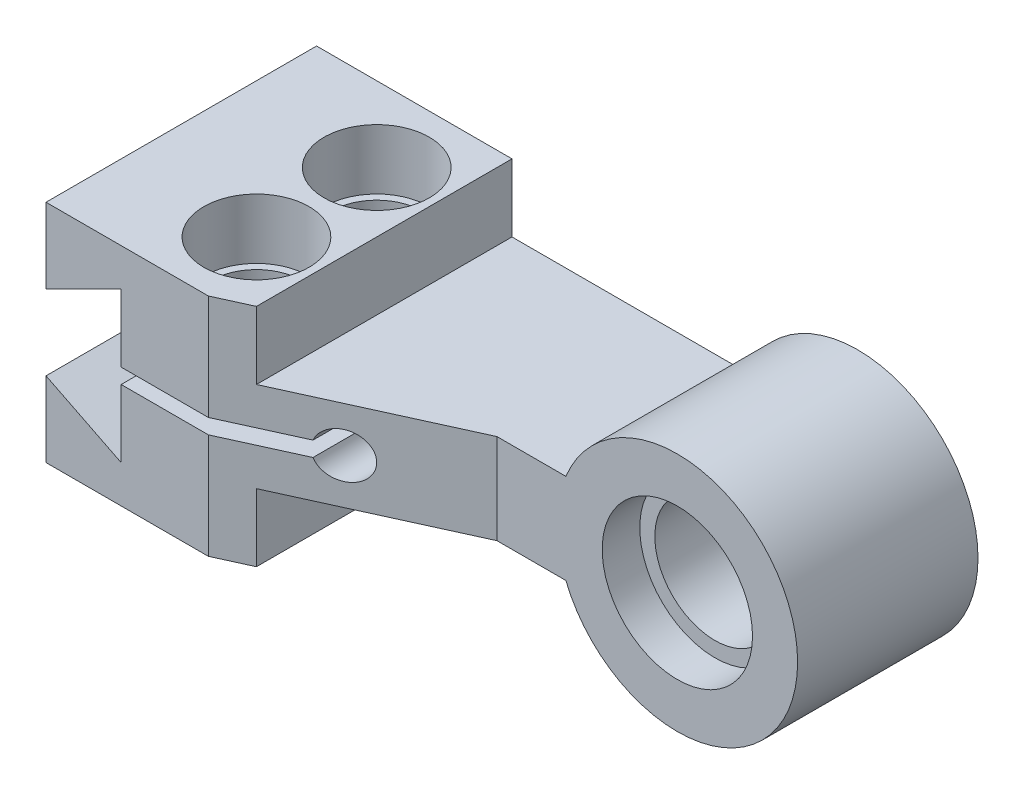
from build123d import *

# Parameters (mm, degrees)
SKETCH_1_R           = 8
SKETCH_1_R_2         = 4
EXTRUDE_1_DEPTH      = 12
EXTRUDE_2_DEPTH      = 3
EXTRUDE_3_DEPTH      = 7.5
CUT_EXTRUDE_1_DEPTH  = 42.036569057
CUT_EXTRUDE_16_REACH = 45.131
SKETCH_9_R           = 3
SKETCH_10_R          = 3.5
CUT_EXTRUDE_17_DEPTH = 4
HOLE_WIZARD_M5_3_D   = 5
SKETCH_15_R          = 5
CUT_EXTRUDE_18_DEPTH = 2.5


with BuildPart() as part:
    # Sketch 1 → Extrude 1 (new body)
    with BuildSketch(Plane.XY):
        Circle(SKETCH_1_R)
        Circle(SKETCH_1_R_2, mode=Mode.SUBTRACT)
    extrude(amount=EXTRUDE_1_DEPTH)

    # Sketch 2 → Extrude 2 (add, symmetric)
    with BuildSketch(Plane(origin=(0, 0, 0), x_dir=(1, 0, 0), z_dir=(0, 1, 0))):
        Polygon((-23, 0), (-23, -17), (-12, -12), (-5.30385942, -12), (-5.30385942, 0), align=None)
    extrude(amount=EXTRUDE_2_DEPTH, both=True)

    # Sketch 3 → Extrude 3 (add, symmetric)
    with BuildSketch(Plane(origin=(0, 0, 0), x_dir=(1, 0, 0), z_dir=(0, 1, 0))):
        Polygon((-23, 0), (-36, 0), (-36, -18), (-25.2, -18), (-23, -17), align=None)
    extrude(amount=EXTRUDE_3_DEPTH, both=True)

    # Sketch 5 → Cut-Extrude 1 (cut, through all)
    with BuildSketch(Plane.XY):
        with BuildLine():
            Line((-20.414213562, 0.5), (-31, 0.5))
            Line((-31, 0.5), (-31, 5))
            Line((-31, 5), (-36, 2.5))
            Line((-36, 2.5), (-36, -2.5))
            Line((-36, -2.5), (-31, -5))
            Line((-31, -5), (-31, -0.5))
            Line((-31, -0.5), (-20.414213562, -0.5))
            ThreePointArc((-20.414213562, -0.5), (-17.5, 0), (-20.414213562, 0.5))
        make_face()
    extrude(amount=CUT_EXTRUDE_1_DEPTH, mode=Mode.SUBTRACT)

    # Sketch 9 → Cut-Extrude 16 (cut, up to next)
    with BuildSketch(Plane(origin=(0, 7.5, 0), x_dir=(1, 0, 0), z_dir=(0, 1, 0)), mode=Mode.PRIVATE) as cut_extrude_16_sk1:
        with Locations(Location((-27, -13, 0), (0, 0, 270))):
            Circle(SKETCH_9_R)
    cut_extrude_16_tool1 = extrude(cut_extrude_16_sk1.sketch, amount=-CUT_EXTRUDE_16_REACH, mode=Mode.PRIVATE) & part.part
    # Sketch 9 → Cut-Extrude 16 (cut, up to next)
    with BuildSketch(Plane(origin=(0, 7.5, 0), x_dir=(1, 0, 0), z_dir=(0, 1, 0)), mode=Mode.PRIVATE) as cut_extrude_16_sk2:
        with Locations(Location((-27, -5, 0), (0, 0, 270))):
            Circle(SKETCH_9_R)
    cut_extrude_16_tool2 = extrude(cut_extrude_16_sk2.sketch, amount=-CUT_EXTRUDE_16_REACH, mode=Mode.PRIVATE) & part.part
    add(cut_extrude_16_tool1.solids().sort_by_distance((-27, 7.5, 13))[0], mode=Mode.SUBTRACT)
    add(cut_extrude_16_tool2.solids().sort_by_distance((-27, 7.5, 5))[0], mode=Mode.SUBTRACT)

    # Sketch 10 → Cut-Extrude 17 (cut)
    with BuildSketch(Plane(origin=(0, 7.5, 0), x_dir=(1, 0, 0), z_dir=(0, 1, 0))):
        with Locations(Location((-27, -5, 0), (0, 0, 270))):
            Circle(SKETCH_10_R)
        with Locations(Location((-27, -13, 0), (0, 0, 270))):
            Circle(SKETCH_10_R)
    extrude(amount=-CUT_EXTRUDE_17_DEPTH, mode=Mode.SUBTRACT)

    # Hole Wizard M5 _3 (through all)
    with Locations(Plane(origin=(-27, -7.5, 13), x_dir=(0, 0, -1), z_dir=(0, -1, 0))):
        with Locations((0, 0), (8, 0)):
            Hole(HOLE_WIZARD_M5_3_D / 2)

    # Sketch 15 → Cut-Extrude 18 (cut)
    with BuildSketch(Plane.XY.offset(12)):
        Circle(SKETCH_15_R)
    extrude(amount=-CUT_EXTRUDE_18_DEPTH, mode=Mode.SUBTRACT)


solid = part.part
